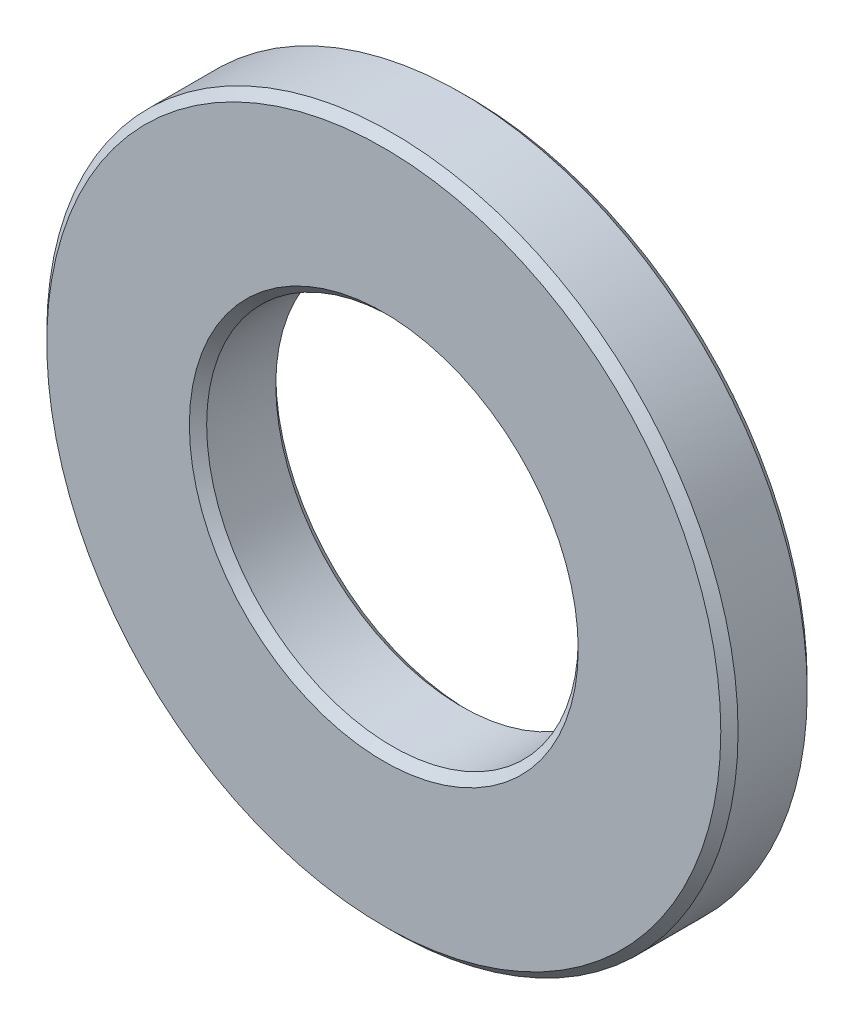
from build123d import *

# Parameters (mm, degrees)
SKETCH1_R           = 4
SKETCH1_R_2         = 2.15
BOSS_EXTRUDE2_DEPTH = 0.5
CHAMFER3_SIZE       = 0.1


with BuildPart() as part:
    # Sketch1 → Boss-Extrude2 (new, symmetric)
    with BuildSketch(Plane.XY):
        Circle(SKETCH1_R)
        Circle(SKETCH1_R_2, mode=Mode.SUBTRACT)
    extrude(amount=BOSS_EXTRUDE2_DEPTH, both=True)

    # Chamfer3
    chamfer3_edges = [part.edges().sort_by_distance(p)[0] for p in [
        (-4, 0, -0.5),
        (-4, 0, 0.5),
        (-2.15, 0, -0.5),
        (-2.15, 0, 0.5),
    ]]
    chamfer(chamfer3_edges, length=CHAMFER3_SIZE)


solid = part.part
